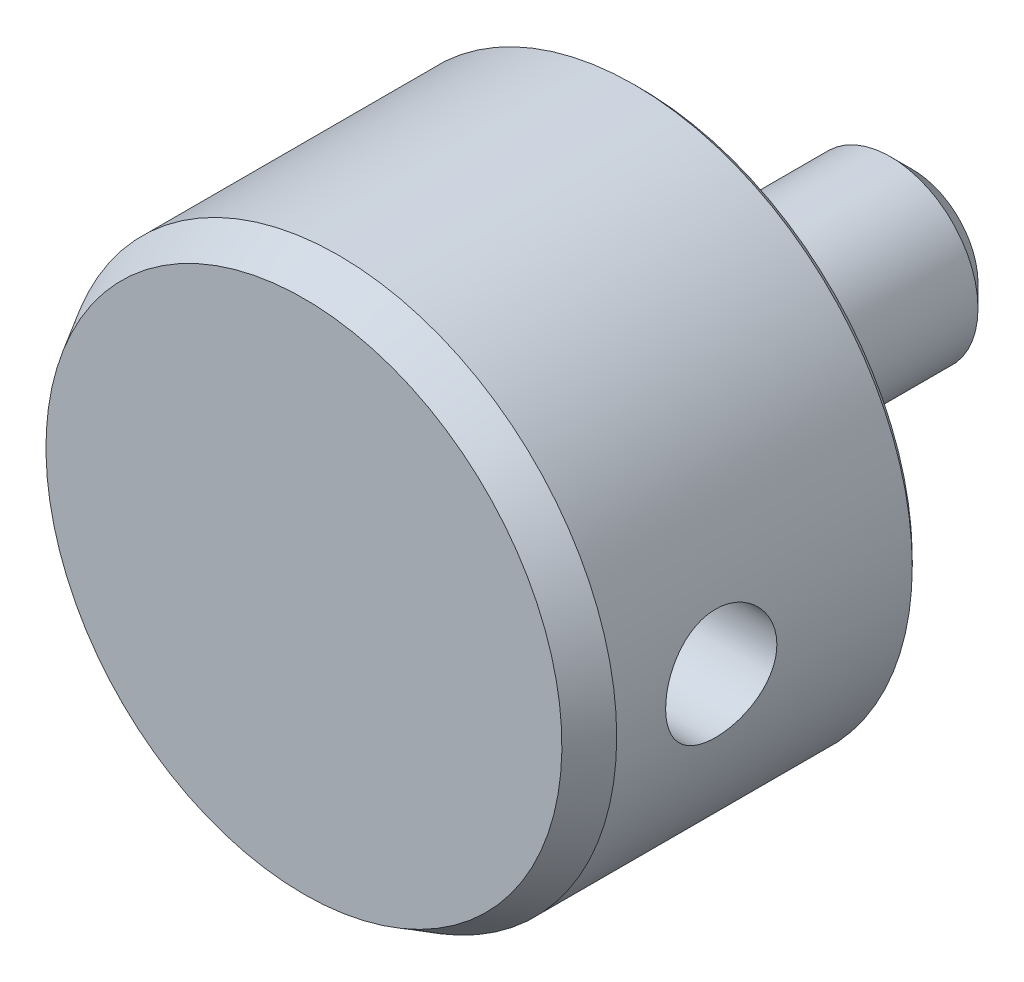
ISO-10303-21;
HEADER;
FILE_DESCRIPTION(('STEP AP214'),'2;1');
FILE_NAME('part.step','',(''),(''),'','','');
FILE_SCHEMA(('AUTOMOTIVE_DESIGN { 1 0 10303 214 1 1 1 1 }'));
ENDSEC;
DATA;
#1=APPLICATION_CONTEXT('core data for automotive mechanical design processes');
#2=APPLICATION_PROTOCOL_DEFINITION('international standard','automotive_design',2000,#1);
#3=PRODUCT_CONTEXT('',#1,'mechanical');
#4=PRODUCT('Part','Part','',(#3));
#5=PRODUCT_RELATED_PRODUCT_CATEGORY('part','',(#4));
#6=PRODUCT_DEFINITION_FORMATION('','',#4);
#7=PRODUCT_DEFINITION_CONTEXT('part definition',#1,'design');
#8=PRODUCT_DEFINITION('design','',#6,#7);
#9=PRODUCT_DEFINITION_SHAPE('','',#8);
#10=(LENGTH_UNIT() NAMED_UNIT(*) SI_UNIT(.MILLI.,.METRE.));
#11=(NAMED_UNIT(*) PLANE_ANGLE_UNIT() SI_UNIT($,.RADIAN.));
#12=(NAMED_UNIT(*) SI_UNIT($,.STERADIAN.) SOLID_ANGLE_UNIT());
#13=UNCERTAINTY_MEASURE_WITH_UNIT(LENGTH_MEASURE(1.E-05),#10,'distance_accuracy_value','');
#14=(GEOMETRIC_REPRESENTATION_CONTEXT(3) GLOBAL_UNCERTAINTY_ASSIGNED_CONTEXT((#13)) GLOBAL_UNIT_ASSIGNED_CONTEXT((#10,
#11,#12)) REPRESENTATION_CONTEXT('',''));
#15=CARTESIAN_POINT('',(0.,0.,0.));
#16=DIRECTION('',(0.,0.,1.));
#17=DIRECTION('',(1.,0.,0.));
#18=AXIS2_PLACEMENT_3D('',#15,#16,#17);
#19=CARTESIAN_POINT('',(0.,0.,-30.1625));
#20=DIRECTION('',(0.,0.,-1.));
#21=DIRECTION('',(0.,-1.,0.));
#22=AXIS2_PLACEMENT_3D('',#19,#20,#21);
#23=CYLINDRICAL_SURFACE('',#22,9.99998);
#24=CARTESIAN_POINT('',(0.,0.,-8.16631719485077));
#25=DIRECTION('',(0.,0.,-1.));
#26=DIRECTION('',(0.,-1.,0.));
#27=AXIS2_PLACEMENT_3D('',#24,#25,#26);
#28=CIRCLE('',#27,9.99998);
#29=CARTESIAN_POINT('',(0.,-9.99998000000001,-8.16631719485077));
#30=VERTEX_POINT('',#29);
#31=EDGE_CURVE('E97',#30,#30,#28,.T.);
#32=ORIENTED_EDGE('',*,*,#31,.T.);
#33=EDGE_LOOP('',(#32));
#34=FACE_BOUND('',#33,.T.);
#35=CARTESIAN_POINT('',(0.,0.,-27.7));
#36=DIRECTION('',(0.,0.,1.));
#37=DIRECTION('',(1.,0.,0.));
#38=AXIS2_PLACEMENT_3D('',#35,#36,#37);
#39=CIRCLE('',#38,9.99998);
#40=CARTESIAN_POINT('',(9.99998,0.,-27.7));
#41=VERTEX_POINT('',#40);
#42=EDGE_CURVE('E93',#41,#41,#39,.T.);
#43=ORIENTED_EDGE('',*,*,#42,.T.);
#44=EDGE_LOOP('',(#43));
#45=FACE_BOUND('',#44,.T.);
#46=ADVANCED_FACE('F12',(#34,#45),#23,.T.);
#47=CARTESIAN_POINT('',(0.,0.,-8.16631719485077));
#48=DIRECTION('',(0.,0.,-1.));
#49=DIRECTION('',(0.,-1.,0.));
#50=AXIS2_PLACEMENT_3D('',#47,#48,#49);
#51=CONICAL_SURFACE('',#50,9.99998,0.523598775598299);
#52=CARTESIAN_POINT('',(0.,0.,-4.572));
#53=DIRECTION('',(0.,0.,-1.));
#54=DIRECTION('',(0.,-1.,0.));
#55=AXIS2_PLACEMENT_3D('',#52,#53,#54);
#56=CIRCLE('',#55,7.9248);
#57=CARTESIAN_POINT('',(0.,-7.9248,-4.572));
#58=VERTEX_POINT('',#57);
#59=EDGE_CURVE('E100',#58,#58,#56,.T.);
#60=ORIENTED_EDGE('',*,*,#59,.T.);
#61=EDGE_LOOP('',(#60));
#62=FACE_BOUND('',#61,.T.);
#63=ORIENTED_EDGE('',*,*,#31,.F.);
#64=EDGE_LOOP('',(#63));
#65=FACE_BOUND('',#64,.T.);
#66=ADVANCED_FACE('F56',(#62,#65),#51,.T.);
#67=CARTESIAN_POINT('',(0.,0.,-30.1625));
#68=DIRECTION('',(0.,0.,-1.));
#69=DIRECTION('',(0.,-1.,0.));
#70=AXIS2_PLACEMENT_3D('',#67,#68,#69);
#71=CYLINDRICAL_SURFACE('',#70,7.9248);
#72=CARTESIAN_POINT('',(0.,0.,0.));
#73=DIRECTION('',(0.,0.,-1.));
#74=DIRECTION('',(0.,-1.,0.));
#75=AXIS2_PLACEMENT_3D('',#72,#73,#74);
#76=CIRCLE('',#75,7.9248);
#77=CARTESIAN_POINT('',(0.,-7.9248,0.));
#78=VERTEX_POINT('',#77);
#79=EDGE_CURVE('E113',#78,#78,#76,.T.);
#80=ORIENTED_EDGE('',*,*,#79,.T.);
#81=EDGE_LOOP('',(#80));
#82=FACE_BOUND('',#81,.T.);
#83=ORIENTED_EDGE('',*,*,#59,.F.);
#84=EDGE_LOOP('',(#83));
#85=FACE_BOUND('',#84,.T.);
#86=ADVANCED_FACE('F60',(#82,#85),#71,.T.);
#87=CARTESIAN_POINT('',(0.,-7.9248,0.));
#88=DIRECTION('',(0.,0.,-1.));
#89=DIRECTION('',(0.,-1.,0.));
#90=AXIS2_PLACEMENT_3D('',#87,#88,#89);
#91=PLANE('',#90);
#92=CARTESIAN_POINT('',(0.,0.,0.));
#93=DIRECTION('',(0.,0.,-1.));
#94=DIRECTION('',(0.,-1.,0.));
#95=AXIS2_PLACEMENT_3D('',#92,#93,#94);
#96=CIRCLE('',#95,12.7);
#97=CARTESIAN_POINT('',(0.,-12.7,0.));
#98=VERTEX_POINT('',#97);
#99=EDGE_CURVE('E110',#98,#98,#96,.T.);
#100=ORIENTED_EDGE('',*,*,#99,.T.);
#101=EDGE_LOOP('',(#100));
#102=FACE_BOUND('',#101,.T.);
#103=ORIENTED_EDGE('',*,*,#79,.F.);
#104=EDGE_LOOP('',(#103));
#105=FACE_BOUND('',#104,.T.);
#106=ADVANCED_FACE('F64',(#102,#105),#91,.T.);
#107=CARTESIAN_POINT('',(0.,0.,-30.1625));
#108=DIRECTION('',(0.,0.,-1.));
#109=DIRECTION('',(0.,-1.,0.));
#110=AXIS2_PLACEMENT_3D('',#107,#108,#109);
#111=CYLINDRICAL_SURFACE('',#110,12.7);
#112=CARTESIAN_POINT('',(0.,0.,0.79375));
#113=DIRECTION('',(0.,0.,-1.));
#114=DIRECTION('',(0.,-1.,0.));
#115=AXIS2_PLACEMENT_3D('',#112,#113,#114);
#116=CIRCLE('',#115,12.7);
#117=CARTESIAN_POINT('',(0.,-12.7,0.79375));
#118=VERTEX_POINT('',#117);
#119=EDGE_CURVE('E107',#118,#118,#116,.T.);
#120=ORIENTED_EDGE('',*,*,#119,.T.);
#121=EDGE_LOOP('',(#120));
#122=FACE_BOUND('',#121,.T.);
#123=ORIENTED_EDGE('',*,*,#99,.F.);
#124=EDGE_LOOP('',(#123));
#125=FACE_BOUND('',#124,.T.);
#126=ADVANCED_FACE('F68',(#122,#125),#111,.T.);
#127=CARTESIAN_POINT('',(0.,-12.7,0.79375));
#128=DIRECTION('',(0.,0.,-1.));
#129=DIRECTION('',(0.,-1.,0.));
#130=AXIS2_PLACEMENT_3D('',#127,#128,#129);
#131=PLANE('',#130);
#132=CARTESIAN_POINT('',(0.,0.,0.79375));
#133=DIRECTION('',(0.,0.,-1.));
#134=DIRECTION('',(0.,-1.,0.));
#135=AXIS2_PLACEMENT_3D('',#132,#133,#134);
#136=CIRCLE('',#135,30.988);
#137=CARTESIAN_POINT('',(0.,-30.988,0.79375));
#138=VERTEX_POINT('',#137);
#139=EDGE_CURVE('E104',#138,#138,#136,.T.);
#140=ORIENTED_EDGE('',*,*,#139,.T.);
#141=EDGE_LOOP('',(#140));
#142=FACE_BOUND('',#141,.T.);
#143=ORIENTED_EDGE('',*,*,#119,.F.);
#144=EDGE_LOOP('',(#143));
#145=FACE_BOUND('',#144,.T.);
#146=ADVANCED_FACE('F52',(#142,#145),#131,.T.);
#147=CARTESIAN_POINT('',(0.,-29.4586411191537,39.27475));
#148=DIRECTION('',(0.,0.,1.));
#149=DIRECTION('',(0.,1.,0.));
#150=AXIS2_PLACEMENT_3D('',#147,#148,#149);
#151=PLANE('',#150);
#152=CARTESIAN_POINT('',(0.,0.,39.27475));
#153=DIRECTION('',(0.,0.,-1.));
#154=DIRECTION('',(0.,-1.,0.));
#155=AXIS2_PLACEMENT_3D('',#152,#153,#154);
#156=CIRCLE('',#155,29.4586411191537);
#157=CARTESIAN_POINT('',(0.,-29.4586411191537,39.27475));
#158=VERTEX_POINT('',#157);
#159=EDGE_CURVE('E31',#158,#158,#156,.T.);
#160=ORIENTED_EDGE('',*,*,#159,.F.);
#161=EDGE_LOOP('',(#160));
#162=FACE_BOUND('',#161,.T.);
#163=ADVANCED_FACE('F49',(#162),#151,.T.);
#164=CARTESIAN_POINT('',(0.,0.,0.79375));
#165=DIRECTION('',(0.,0.,1.));
#166=DIRECTION('',(0.,1.,0.));
#167=AXIS2_PLACEMENT_3D('',#164,#165,#166);
#168=CONICAL_SURFACE('',#167,30.988,0.78539816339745);
#169=CARTESIAN_POINT('',(0.,0.,1.55575));
#170=DIRECTION('',(0.,0.,-1.));
#171=DIRECTION('',(0.,-1.,0.));
#172=AXIS2_PLACEMENT_3D('',#169,#170,#171);
#173=CIRCLE('',#172,31.75);
#174=CARTESIAN_POINT('',(0.,-31.75,1.55575));
#175=VERTEX_POINT('',#174);
#176=EDGE_CURVE('E37',#175,#175,#173,.T.);
#177=ORIENTED_EDGE('',*,*,#176,.T.);
#178=EDGE_LOOP('',(#177));
#179=FACE_BOUND('',#178,.T.);
#180=ORIENTED_EDGE('',*,*,#139,.F.);
#181=EDGE_LOOP('',(#180));
#182=FACE_BOUND('',#181,.T.);
#183=ADVANCED_FACE('F47',(#179,#182),#168,.T.);
#184=CARTESIAN_POINT('',(0.,0.,35.306));
#185=DIRECTION('',(0.,0.,-1.));
#186=DIRECTION('',(0.,-1.,0.));
#187=AXIS2_PLACEMENT_3D('',#184,#185,#186);
#188=CONICAL_SURFACE('',#187,31.75,0.523598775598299);
#189=ORIENTED_EDGE('',*,*,#159,.T.);
#190=EDGE_LOOP('',(#189));
#191=FACE_BOUND('',#190,.T.);
#192=CARTESIAN_POINT('',(0.,0.,35.306));
#193=DIRECTION('',(0.,0.,-1.));
#194=DIRECTION('',(0.,-1.,0.));
#195=AXIS2_PLACEMENT_3D('',#192,#193,#194);
#196=CIRCLE('',#195,31.75);
#197=CARTESIAN_POINT('',(0.,-31.75,35.306));
#198=VERTEX_POINT('',#197);
#199=EDGE_CURVE('E27',#198,#198,#196,.T.);
#200=ORIENTED_EDGE('',*,*,#199,.F.);
#201=EDGE_LOOP('',(#200));
#202=FACE_BOUND('',#201,.T.);
#203=ADVANCED_FACE('F42',(#191,#202),#188,.T.);
#204=CARTESIAN_POINT('',(0.,0.,-30.1625));
#205=DIRECTION('',(0.,0.,-1.));
#206=DIRECTION('',(0.,-1.,0.));
#207=AXIS2_PLACEMENT_3D('',#204,#205,#206);
#208=CYLINDRICAL_SURFACE('',#207,31.75);
#209=CARTESIAN_POINT('',(-31.75,0.,17.018));
#210=CARTESIAN_POINT('',(-31.750001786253,-0.17651587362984,17.0179964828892));
#211=CARTESIAN_POINT('',(-31.7485254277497,-0.352987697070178,17.0253620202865));
#212=CARTESIAN_POINT('',(-31.7426651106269,-0.704709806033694,17.0547588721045));
#213=CARTESIAN_POINT('',(-31.7382806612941,-0.879959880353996,17.076792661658));
#214=CARTESIAN_POINT('',(-31.7267212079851,-1.22801018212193,17.1353715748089));
#215=CARTESIAN_POINT('',(-31.7195447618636,-1.40080909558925,17.1719241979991));
#216=CARTESIAN_POINT('',(-31.7025988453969,-1.74270808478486,17.2592678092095));
#217=CARTESIAN_POINT('',(-31.6928284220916,-1.91180677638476,17.3100640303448));
#218=CARTESIAN_POINT('',(-31.6709811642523,-2.24483065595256,17.4254207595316));
#219=CARTESIAN_POINT('',(-31.6589074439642,-2.40876248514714,17.4899626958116));
#220=CARTESIAN_POINT('',(-31.6327719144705,-2.73062697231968,17.6323954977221));
#221=CARTESIAN_POINT('',(-31.6187093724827,-2.88855739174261,17.7102912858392));
#222=CARTESIAN_POINT('',(-31.5889902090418,-3.19722223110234,17.878812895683));
#223=CARTESIAN_POINT('',(-31.5733343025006,-3.34795983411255,17.9694330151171));
#224=CARTESIAN_POINT('',(-31.5408421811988,-3.64136966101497,18.1628283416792));
#225=CARTESIAN_POINT('',(-31.5240055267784,-3.78403884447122,18.2656080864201));
#226=CARTESIAN_POINT('',(-31.4894105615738,-4.06194074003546,18.4838705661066));
#227=CARTESIAN_POINT('',(-31.4716437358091,-4.19706617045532,18.599488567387));
#228=CARTESIAN_POINT('',(-31.435860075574,-4.45717927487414,18.8416722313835));
#229=CARTESIAN_POINT('',(-31.4178431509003,-4.58216317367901,18.9682419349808));
#230=CARTESIAN_POINT('',(-31.3820725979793,-4.82105872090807,19.2313994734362));
#231=CARTESIAN_POINT('',(-31.3643188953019,-4.93497355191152,19.3679844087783));
#232=CARTESIAN_POINT('',(-31.329560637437,-5.15103007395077,19.6503390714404));
#233=CARTESIAN_POINT('',(-31.3125563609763,-5.25316740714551,19.7961121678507));
#234=CARTESIAN_POINT('',(-31.2796421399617,-5.44574317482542,20.0971314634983));
#235=CARTESIAN_POINT('',(-31.2637430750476,-5.5360714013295,20.2524494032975));
#236=CARTESIAN_POINT('',(-31.2336627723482,-5.70333527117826,20.5703672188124));
#237=CARTESIAN_POINT('',(-31.219482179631,-5.78026589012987,20.7329697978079));
#238=CARTESIAN_POINT('',(-31.1932725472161,-5.92007801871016,21.0642092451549));
#239=CARTESIAN_POINT('',(-31.1812425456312,-5.98296581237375,21.2328433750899));
#240=CARTESIAN_POINT('',(-31.1596797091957,-6.09426120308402,21.5749779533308));
#241=CARTESIAN_POINT('',(-31.1501477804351,-6.14266354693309,21.7484801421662));
#242=CARTESIAN_POINT('',(-31.1259929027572,-6.26436580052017,22.269824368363));
#243=CARTESIAN_POINT('',(-31.1154218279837,-6.31616350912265,22.6232665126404));
#244=CARTESIAN_POINT('',(-31.1087311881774,-6.34895807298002,23.155713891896));
#245=CARTESIAN_POINT('',(-31.1080302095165,-6.35239822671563,23.3336494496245));
#246=CARTESIAN_POINT('',(-31.1096704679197,-6.34436208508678,23.6891912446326));
#247=CARTESIAN_POINT('',(-31.1120117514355,-6.33288556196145,23.8667974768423));
#248=CARTESIAN_POINT('',(-31.123422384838,-6.2766899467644,24.391719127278));
#249=CARTESIAN_POINT('',(-31.1368107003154,-6.2105456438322,24.7368888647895));
#250=CARTESIAN_POINT('',(-31.1737072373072,-6.02257965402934,25.4109501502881));
#251=CARTESIAN_POINT('',(-31.1972159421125,-5.90075530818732,25.7398409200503));
#252=CARTESIAN_POINT('',(-31.2518821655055,-5.6040326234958,26.3748075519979));
#253=CARTESIAN_POINT('',(-31.2830903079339,-5.42878112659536,26.6807141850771));
#254=CARTESIAN_POINT('',(-31.3496081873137,-5.03042913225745,27.2590987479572));
#255=CARTESIAN_POINT('',(-31.3849183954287,-4.80732313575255,27.5315728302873));
#256=CARTESIAN_POINT('',(-31.4564408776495,-4.31482460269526,28.0405156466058));
#257=CARTESIAN_POINT('',(-31.4926579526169,-4.04467162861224,28.2762485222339));
#258=CARTESIAN_POINT('',(-31.5613318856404,-3.46827489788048,28.699167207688));
#259=CARTESIAN_POINT('',(-31.5937886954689,-3.16203067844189,28.8863523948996));
#260=CARTESIAN_POINT('',(-31.6513648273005,-2.52132710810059,29.2069996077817));
#261=CARTESIAN_POINT('',(-31.6764726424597,-2.18682455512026,29.3403775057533));
#262=CARTESIAN_POINT('',(-31.7164344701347,-1.49954599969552,29.5488390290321));
#263=CARTESIAN_POINT('',(-31.7312897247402,-1.14677221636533,29.6239297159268));
#264=CARTESIAN_POINT('',(-31.7488996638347,-0.43928922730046,29.7126434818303));
#265=CARTESIAN_POINT('',(-31.751852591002,-0.0847110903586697,29.7272736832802));
#266=CARTESIAN_POINT('',(-31.7458757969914,0.621823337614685,29.6973633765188));
#267=CARTESIAN_POINT('',(-31.73694674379,0.973779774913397,29.6528261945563));
#268=CARTESIAN_POINT('',(-31.7083333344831,1.66183092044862,29.5066824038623));
#269=CARTESIAN_POINT('',(-31.6887464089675,1.99803979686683,29.405592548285));
#270=CARTESIAN_POINT('',(-31.6410055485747,2.64873510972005,29.1497764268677));
#271=CARTESIAN_POINT('',(-31.6128509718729,2.96321991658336,28.9950461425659));
#272=CARTESIAN_POINT('',(-31.5506044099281,3.56578616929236,28.6341672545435));
#273=CARTESIAN_POINT('',(-31.5164439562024,3.85349724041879,28.4274123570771));
#274=CARTESIAN_POINT('',(-31.4461355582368,4.39050548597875,27.9691476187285));
#275=CARTESIAN_POINT('',(-31.4099874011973,4.6397985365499,27.717632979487));
#276=CARTESIAN_POINT('',(-31.339111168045,5.0967637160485,27.1724694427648));
#277=CARTESIAN_POINT('',(-31.3044130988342,5.30374424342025,26.8782372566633));
#278=CARTESIAN_POINT('',(-31.240994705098,5.66539258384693,26.2583906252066));
#279=CARTESIAN_POINT('',(-31.2122741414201,5.82006248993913,25.9327774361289));
#280=CARTESIAN_POINT('',(-31.1762701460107,6.00888128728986,25.4290562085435));
#281=CARTESIAN_POINT('',(-31.1654635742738,6.06455145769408,25.2589710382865));
#282=CARTESIAN_POINT('',(-31.1464680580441,6.16137084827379,24.9145896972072));
#283=CARTESIAN_POINT('',(-31.1382781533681,6.20252539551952,24.7402950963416));
#284=CARTESIAN_POINT('',(-31.1247656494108,6.26997942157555,24.3887413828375));
#285=CARTESIAN_POINT('',(-31.1194432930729,6.29627764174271,24.2114820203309));
#286=CARTESIAN_POINT('',(-31.1118270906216,6.33380495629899,23.8553123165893));
#287=CARTESIAN_POINT('',(-31.1095331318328,6.34503461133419,23.6764020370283));
#288=CARTESIAN_POINT('',(-31.1080575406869,6.35226474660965,23.3215129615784));
#289=CARTESIAN_POINT('',(-31.1088201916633,6.34853785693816,23.1455398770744));
#290=CARTESIAN_POINT('',(-31.113309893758,6.32649775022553,22.7945503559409));
#291=CARTESIAN_POINT('',(-31.1170368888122,6.30818480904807,22.6195339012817));
#292=CARTESIAN_POINT('',(-31.1273463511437,6.25711483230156,22.2716775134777));
#293=CARTESIAN_POINT('',(-31.1339293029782,6.22435534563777,22.0988379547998));
#294=CARTESIAN_POINT('',(-31.1497552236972,6.14466408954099,21.7566485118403));
#295=CARTESIAN_POINT('',(-31.1589972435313,6.09773737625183,21.5872974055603));
#296=CARTESIAN_POINT('',(-31.179852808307,5.99018114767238,21.2535484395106));
#297=CARTESIAN_POINT('',(-31.1914613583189,5.92958046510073,21.0891409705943));
#298=CARTESIAN_POINT('',(-31.2167268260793,5.79509639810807,20.7660852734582));
#299=CARTESIAN_POINT('',(-31.2303830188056,5.72121771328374,20.6074350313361));
#300=CARTESIAN_POINT('',(-31.2593696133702,5.56066227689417,20.2968256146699));
#301=CARTESIAN_POINT('',(-31.2747007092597,5.47398021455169,20.1448692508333));
#302=CARTESIAN_POINT('',(-31.3066021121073,5.2884794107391,19.8487674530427));
#303=CARTESIAN_POINT('',(-31.3231719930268,5.18966483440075,19.7046193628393));
#304=CARTESIAN_POINT('',(-31.3573974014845,4.97872853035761,19.4225840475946));
#305=CARTESIAN_POINT('',(-31.3750667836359,4.86640554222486,19.284848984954));
#306=CARTESIAN_POINT('',(-31.4107227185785,4.63068014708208,19.0193443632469));
#307=CARTESIAN_POINT('',(-31.4287091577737,4.50728164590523,18.8915713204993));
#308=CARTESIAN_POINT('',(-31.464516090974,4.25012766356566,18.6467234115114));
#309=CARTESIAN_POINT('',(-31.4823364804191,4.11636609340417,18.5296549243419));
#310=CARTESIAN_POINT('',(-31.517300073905,3.83949929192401,18.3071427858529));
#311=CARTESIAN_POINT('',(-31.5344435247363,3.69639751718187,18.2016948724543));
#312=CARTESIAN_POINT('',(-31.5677659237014,3.40016257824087,18.0020290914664));
#313=CARTESIAN_POINT('',(-31.5839323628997,3.24693728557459,17.9079457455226));
#314=CARTESIAN_POINT('',(-31.6146312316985,2.93299471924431,17.7330805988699));
#315=CARTESIAN_POINT('',(-31.629164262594,2.77228023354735,17.6522938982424));
#316=CARTESIAN_POINT('',(-31.6561810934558,2.4445256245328,17.5046328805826));
#317=CARTESIAN_POINT('',(-31.6686661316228,2.27748939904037,17.4377501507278));
#318=CARTESIAN_POINT('',(-31.6912384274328,1.93825421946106,17.3183706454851));
#319=CARTESIAN_POINT('',(-31.7013261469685,1.76605626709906,17.265871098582));
#320=CARTESIAN_POINT('',(-31.7230870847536,1.33248673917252,17.1536066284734));
#321=CARTESIAN_POINT('',(-31.7331270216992,1.06865101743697,17.1028235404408));
#322=CARTESIAN_POINT('',(-31.7465820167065,0.536509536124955,17.0350234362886));
#323=CARTESIAN_POINT('',(-31.7499972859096,0.268203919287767,17.0180053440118));
#324=CARTESIAN_POINT('',(-31.75,0.,17.018));
#325=B_SPLINE_CURVE_WITH_KNOTS('',3,(#209,#210,#211,#212,#213,#214,#215,#216,#217,#218,#219,
#220,#221,#222,#223,#224,#225,#226,#227,#228,#229,#230,#231,#232,#233,#234,#235,#236,#237,#238,
#239,#240,#241,#242,#243,#244,#245,#246,#247,#248,#249,#250,#251,#252,#253,#254,#255,#256,#257,
#258,#259,#260,#261,#262,#263,#264,#265,#266,#267,#268,#269,#270,#271,#272,#273,#274,#275,#276,
#277,#278,#279,#280,#281,#282,#283,#284,#285,#286,#287,#288,#289,#290,#291,#292,#293,#294,#295,
#296,#297,#298,#299,#300,#301,#302,#303,#304,#305,#306,#307,#308,#309,#310,#311,#312,#313,#314,
#315,#316,#317,#318,#319,#320,#321,#322,#323,#324),.UNSPECIFIED.,.T.,.F.,(4,2,2,2,2,2,2,2,2,2,2,
2,2,2,2,2,2,2,2,2,2,2,2,2,2,2,2,2,2,2,2,2,2,2,2,2,2,2,2,2,2,2,2,2,2,2,2,2,2,2,2,2,2,2,2,2,2,4),
(0.,0.529312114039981,1.05871356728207,1.58838883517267,2.11825896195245,2.64741767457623,
3.17677186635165,3.7058895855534,4.23520538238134,4.77075073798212,5.30649454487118,
5.8420838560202,6.37787071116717,6.91834660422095,7.45902475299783,7.99946046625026,
8.54009193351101,9.60600520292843,10.1393933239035,10.672789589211,11.7225222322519,
12.772305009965,13.8291831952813,14.8861828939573,15.9621966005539,17.0382241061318,
18.1159275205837,19.1935003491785,20.253049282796,21.3125386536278,22.3625013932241,
23.4125428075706,24.4754392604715,25.5384497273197,26.617647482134,27.6968020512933,
28.2341330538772,28.7712666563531,29.3084457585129,29.8456048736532,30.3730174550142,
30.9004200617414,31.4279121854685,31.9552162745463,32.4814187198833,33.0074352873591,
33.533670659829,34.0597258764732,34.594914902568,35.1299159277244,35.665233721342,
36.2003545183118,36.7412917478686,37.2820291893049,37.8224384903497,38.3627435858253,
39.1670231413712,39.9712770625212),.UNSPECIFIED.);
#326=CARTESIAN_POINT('',(-31.75,0.,17.018));
#327=VERTEX_POINT('',#326);
#328=EDGE_CURVE('E23',#327,#327,#325,.T.);
#329=ORIENTED_EDGE('',*,*,#328,.F.);
#330=EDGE_LOOP('',(#329));
#331=FACE_BOUND('',#330,.T.);
#332=CARTESIAN_POINT('',(31.75,0.,17.018));
#333=CARTESIAN_POINT('',(31.750001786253,0.176515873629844,17.0179964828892));
#334=CARTESIAN_POINT('',(31.7485254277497,0.352987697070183,17.0253620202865));
#335=CARTESIAN_POINT('',(31.7426651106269,0.704709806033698,17.0547588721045));
#336=CARTESIAN_POINT('',(31.7382806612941,0.879959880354,17.076792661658));
#337=CARTESIAN_POINT('',(31.7267212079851,1.22801018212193,17.1353715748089));
#338=CARTESIAN_POINT('',(31.7195447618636,1.40080909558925,17.1719241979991));
#339=CARTESIAN_POINT('',(31.7025988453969,1.74270808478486,17.2592678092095));
#340=CARTESIAN_POINT('',(31.6928284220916,1.91180677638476,17.3100640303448));
#341=CARTESIAN_POINT('',(31.6709811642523,2.24483065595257,17.4254207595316));
#342=CARTESIAN_POINT('',(31.6589074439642,2.40876248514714,17.4899626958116));
#343=CARTESIAN_POINT('',(31.6327719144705,2.73062697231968,17.6323954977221));
#344=CARTESIAN_POINT('',(31.6187093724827,2.88855739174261,17.7102912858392));
#345=CARTESIAN_POINT('',(31.5889902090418,3.19722223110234,17.878812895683));
#346=CARTESIAN_POINT('',(31.5733343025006,3.34795983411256,17.9694330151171));
#347=CARTESIAN_POINT('',(31.5408421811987,3.64136966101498,18.1628283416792));
#348=CARTESIAN_POINT('',(31.5240055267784,3.78403884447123,18.26560808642));
#349=CARTESIAN_POINT('',(31.4894105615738,4.06194074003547,18.4838705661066));
#350=CARTESIAN_POINT('',(31.4716437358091,4.19706617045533,18.599488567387));
#351=CARTESIAN_POINT('',(31.435860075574,4.45717927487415,18.8416722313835));
#352=CARTESIAN_POINT('',(31.4178431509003,4.58216317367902,18.9682419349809));
#353=CARTESIAN_POINT('',(31.3820725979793,4.82105872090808,19.2313994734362));
#354=CARTESIAN_POINT('',(31.3643188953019,4.93497355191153,19.3679844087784));
#355=CARTESIAN_POINT('',(31.329560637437,5.15103007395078,19.6503390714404));
#356=CARTESIAN_POINT('',(31.3125563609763,5.25316740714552,19.7961121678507));
#357=CARTESIAN_POINT('',(31.2796421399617,5.44574317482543,20.0971314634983));
#358=CARTESIAN_POINT('',(31.2637430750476,5.53607140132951,20.2524494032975));
#359=CARTESIAN_POINT('',(31.2336627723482,5.70333527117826,20.5703672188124));
#360=CARTESIAN_POINT('',(31.219482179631,5.78026589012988,20.7329697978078));
#361=CARTESIAN_POINT('',(31.1932725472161,5.92007801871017,21.0642092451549));
#362=CARTESIAN_POINT('',(31.1812425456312,5.98296581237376,21.2328433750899));
#363=CARTESIAN_POINT('',(31.1596797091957,6.09426120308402,21.5749779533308));
#364=CARTESIAN_POINT('',(31.1501477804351,6.14266354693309,21.7484801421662));
#365=CARTESIAN_POINT('',(31.1259929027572,6.26436580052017,22.269824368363));
#366=CARTESIAN_POINT('',(31.1154218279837,6.31616350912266,22.6232665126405));
#367=CARTESIAN_POINT('',(31.1087311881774,6.34895807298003,23.155713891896));
#368=CARTESIAN_POINT('',(31.1080302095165,6.35239822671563,23.3336494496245));
#369=CARTESIAN_POINT('',(31.1096704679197,6.34436208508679,23.6891912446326));
#370=CARTESIAN_POINT('',(31.1120117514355,6.33288556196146,23.8667974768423));
#371=CARTESIAN_POINT('',(31.123422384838,6.27668994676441,24.391719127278));
#372=CARTESIAN_POINT('',(31.1368107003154,6.21054564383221,24.7368888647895));
#373=CARTESIAN_POINT('',(31.1737072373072,6.02257965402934,25.4109501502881));
#374=CARTESIAN_POINT('',(31.1972159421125,5.90075530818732,25.7398409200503));
#375=CARTESIAN_POINT('',(31.2518821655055,5.60403262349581,26.3748075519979));
#376=CARTESIAN_POINT('',(31.2830903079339,5.42878112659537,26.6807141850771));
#377=CARTESIAN_POINT('',(31.3496081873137,5.03042913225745,27.2590987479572));
#378=CARTESIAN_POINT('',(31.3849183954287,4.80732313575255,27.5315728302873));
#379=CARTESIAN_POINT('',(31.4564408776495,4.31482460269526,28.0405156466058));
#380=CARTESIAN_POINT('',(31.4926579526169,4.04467162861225,28.2762485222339));
#381=CARTESIAN_POINT('',(31.5613318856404,3.46827489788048,28.699167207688));
#382=CARTESIAN_POINT('',(31.5937886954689,3.16203067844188,28.8863523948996));
#383=CARTESIAN_POINT('',(31.6513648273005,2.52132710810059,29.2069996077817));
#384=CARTESIAN_POINT('',(31.6764726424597,2.18682455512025,29.3403775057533));
#385=CARTESIAN_POINT('',(31.7164344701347,1.49954599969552,29.5488390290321));
#386=CARTESIAN_POINT('',(31.7312897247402,1.14677221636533,29.6239297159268));
#387=CARTESIAN_POINT('',(31.7488996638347,0.43928922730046,29.7126434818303));
#388=CARTESIAN_POINT('',(31.751852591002,0.0847110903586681,29.7272736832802));
#389=CARTESIAN_POINT('',(31.7458757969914,-0.621823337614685,29.6973633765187));
#390=CARTESIAN_POINT('',(31.73694674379,-0.973779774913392,29.6528261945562));
#391=CARTESIAN_POINT('',(31.7083333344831,-1.66183092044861,29.5066824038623));
#392=CARTESIAN_POINT('',(31.6887464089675,-1.99803979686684,29.405592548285));
#393=CARTESIAN_POINT('',(31.6410055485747,-2.64873510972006,29.1497764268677));
#394=CARTESIAN_POINT('',(31.6128509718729,-2.96321991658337,28.9950461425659));
#395=CARTESIAN_POINT('',(31.5506044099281,-3.56578616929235,28.6341672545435));
#396=CARTESIAN_POINT('',(31.5164439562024,-3.85349724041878,28.4274123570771));
#397=CARTESIAN_POINT('',(31.4461355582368,-4.39050548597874,27.9691476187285));
#398=CARTESIAN_POINT('',(31.4099874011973,-4.63979853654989,27.717632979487));
#399=CARTESIAN_POINT('',(31.339111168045,-5.09676371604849,27.1724694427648));
#400=CARTESIAN_POINT('',(31.3044130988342,-5.30374424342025,26.8782372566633));
#401=CARTESIAN_POINT('',(31.240994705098,-5.66539258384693,26.2583906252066));
#402=CARTESIAN_POINT('',(31.2122741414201,-5.82006248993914,25.9327774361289));
#403=CARTESIAN_POINT('',(31.1762701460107,-6.00888128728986,25.4290562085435));
#404=CARTESIAN_POINT('',(31.1654635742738,-6.06455145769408,25.2589710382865));
#405=CARTESIAN_POINT('',(31.1464680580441,-6.16137084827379,24.9145896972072));
#406=CARTESIAN_POINT('',(31.1382781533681,-6.20252539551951,24.7402950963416));
#407=CARTESIAN_POINT('',(31.1247656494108,-6.26997942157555,24.3887413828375));
#408=CARTESIAN_POINT('',(31.1194432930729,-6.2962776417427,24.2114820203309));
#409=CARTESIAN_POINT('',(31.1118270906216,-6.33380495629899,23.8553123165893));
#410=CARTESIAN_POINT('',(31.1095331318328,-6.34503461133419,23.6764020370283));
#411=CARTESIAN_POINT('',(31.1080575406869,-6.35226474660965,23.3215129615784));
#412=CARTESIAN_POINT('',(31.1088201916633,-6.34853785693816,23.1455398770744));
#413=CARTESIAN_POINT('',(31.1133098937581,-6.32649775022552,22.7945503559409));
#414=CARTESIAN_POINT('',(31.1170368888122,-6.30818480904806,22.6195339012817));
#415=CARTESIAN_POINT('',(31.1273463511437,-6.25711483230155,22.2716775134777));
#416=CARTESIAN_POINT('',(31.1339293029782,-6.22435534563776,22.0988379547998));
#417=CARTESIAN_POINT('',(31.1497552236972,-6.14466408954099,21.7566485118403));
#418=CARTESIAN_POINT('',(31.1589972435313,-6.09773737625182,21.5872974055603));
#419=CARTESIAN_POINT('',(31.179852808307,-5.99018114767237,21.2535484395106));
#420=CARTESIAN_POINT('',(31.1914613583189,-5.92958046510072,21.0891409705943));
#421=CARTESIAN_POINT('',(31.2167268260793,-5.79509639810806,20.7660852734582));
#422=CARTESIAN_POINT('',(31.2303830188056,-5.72121771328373,20.6074350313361));
#423=CARTESIAN_POINT('',(31.2593696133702,-5.56066227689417,20.2968256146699));
#424=CARTESIAN_POINT('',(31.2747007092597,-5.47398021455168,20.1448692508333));
#425=CARTESIAN_POINT('',(31.3066021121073,-5.28847941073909,19.8487674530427));
#426=CARTESIAN_POINT('',(31.3231719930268,-5.18966483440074,19.7046193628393));
#427=CARTESIAN_POINT('',(31.3573974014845,-4.9787285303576,19.4225840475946));
#428=CARTESIAN_POINT('',(31.3750667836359,-4.86640554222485,19.284848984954));
#429=CARTESIAN_POINT('',(31.4107227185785,-4.63068014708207,19.0193443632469));
#430=CARTESIAN_POINT('',(31.4287091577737,-4.50728164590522,18.8915713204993));
#431=CARTESIAN_POINT('',(31.464516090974,-4.25012766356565,18.6467234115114));
#432=CARTESIAN_POINT('',(31.4823364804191,-4.11636609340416,18.5296549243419));
#433=CARTESIAN_POINT('',(31.517300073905,-3.839499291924,18.3071427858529));
#434=CARTESIAN_POINT('',(31.5344435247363,-3.69639751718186,18.2016948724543));
#435=CARTESIAN_POINT('',(31.5677659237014,-3.40016257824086,18.0020290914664));
#436=CARTESIAN_POINT('',(31.5839323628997,-3.24693728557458,17.9079457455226));
#437=CARTESIAN_POINT('',(31.6146312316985,-2.9329947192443,17.7330805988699));
#438=CARTESIAN_POINT('',(31.629164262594,-2.77228023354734,17.6522938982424));
#439=CARTESIAN_POINT('',(31.6561810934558,-2.44452562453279,17.5046328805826));
#440=CARTESIAN_POINT('',(31.6686661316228,-2.27748939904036,17.4377501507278));
#441=CARTESIAN_POINT('',(31.6912384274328,-1.93825421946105,17.3183706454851));
#442=CARTESIAN_POINT('',(31.7013261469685,-1.76605626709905,17.265871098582));
#443=CARTESIAN_POINT('',(31.7230870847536,-1.33248673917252,17.1536066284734));
#444=CARTESIAN_POINT('',(31.7331270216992,-1.06865101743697,17.1028235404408));
#445=CARTESIAN_POINT('',(31.7465820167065,-0.53650953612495,17.0350234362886));
#446=CARTESIAN_POINT('',(31.7499972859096,-0.268203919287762,17.0180053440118));
#447=CARTESIAN_POINT('',(31.75,0.,17.018));
#448=B_SPLINE_CURVE_WITH_KNOTS('',3,(#332,#333,#334,#335,#336,#337,#338,#339,#340,#341,#342,
#343,#344,#345,#346,#347,#348,#349,#350,#351,#352,#353,#354,#355,#356,#357,#358,#359,#360,#361,
#362,#363,#364,#365,#366,#367,#368,#369,#370,#371,#372,#373,#374,#375,#376,#377,#378,#379,#380,
#381,#382,#383,#384,#385,#386,#387,#388,#389,#390,#391,#392,#393,#394,#395,#396,#397,#398,#399,
#400,#401,#402,#403,#404,#405,#406,#407,#408,#409,#410,#411,#412,#413,#414,#415,#416,#417,#418,
#419,#420,#421,#422,#423,#424,#425,#426,#427,#428,#429,#430,#431,#432,#433,#434,#435,#436,#437,
#438,#439,#440,#441,#442,#443,#444,#445,#446,#447),.UNSPECIFIED.,.T.,.F.,(4,2,2,2,2,2,2,2,2,2,2,
2,2,2,2,2,2,2,2,2,2,2,2,2,2,2,2,2,2,2,2,2,2,2,2,2,2,2,2,2,2,2,2,2,2,2,2,2,2,2,2,2,2,2,2,2,2,4),
(0.,0.529312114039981,1.05871356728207,1.58838883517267,2.11825896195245,2.64741767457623,
3.17677186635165,3.7058895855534,4.23520538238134,4.77075073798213,5.30649454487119,
5.84208385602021,6.37787071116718,6.91834660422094,7.45902475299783,7.99946046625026,
8.54009193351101,9.60600520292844,10.1393933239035,10.672789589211,11.7225222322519,
12.772305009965,13.8291831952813,14.8861828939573,15.962196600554,17.0382241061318,
18.1159275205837,19.1935003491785,20.253049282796,21.3125386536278,22.3625013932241,
23.4125428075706,24.4754392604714,25.5384497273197,26.617647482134,27.6968020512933,
28.2341330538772,28.7712666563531,29.3084457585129,29.8456048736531,30.3730174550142,
30.9004200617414,31.4279121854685,31.9552162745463,32.4814187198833,33.0074352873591,
33.533670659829,34.0597258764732,34.594914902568,35.1299159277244,35.665233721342,
36.2003545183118,36.7412917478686,37.2820291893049,37.8224384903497,38.3627435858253,
39.1670231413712,39.9712770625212),.UNSPECIFIED.);
#449=CARTESIAN_POINT('',(31.75,0.,17.018));
#450=VERTEX_POINT('',#449);
#451=EDGE_CURVE('E8',#450,#450,#448,.T.);
#452=ORIENTED_EDGE('',*,*,#451,.F.);
#453=EDGE_LOOP('',(#452));
#454=FACE_BOUND('',#453,.T.);
#455=ORIENTED_EDGE('',*,*,#199,.T.);
#456=EDGE_LOOP('',(#455));
#457=FACE_BOUND('',#456,.T.);
#458=ORIENTED_EDGE('',*,*,#176,.F.);
#459=EDGE_LOOP('',(#458));
#460=FACE_BOUND('',#459,.T.);
#461=ADVANCED_FACE('F38',(#331,#454,#457,#460),#208,.T.);
#462=CARTESIAN_POINT('',(-48.41748,0.,23.368));
#463=DIRECTION('',(1.,0.,0.));
#464=DIRECTION('',(0.,0.,-1.));
#465=AXIS2_PLACEMENT_3D('',#462,#463,#464);
#466=CYLINDRICAL_SURFACE('',#465,6.35);
#467=ORIENTED_EDGE('',*,*,#328,.T.);
#468=EDGE_LOOP('',(#467));
#469=FACE_BOUND('',#468,.T.);
#470=ORIENTED_EDGE('',*,*,#451,.T.);
#471=EDGE_LOOP('',(#470));
#472=FACE_BOUND('',#471,.T.);
#473=ADVANCED_FACE('F14',(#469,#472),#466,.F.);
#474=CARTESIAN_POINT('',(0.,7.49998,-30.2));
#475=DIRECTION('',(0.,0.,1.));
#476=DIRECTION('',(1.,0.,0.));
#477=AXIS2_PLACEMENT_3D('',#474,#475,#476);
#478=PLANE('',#477);
#479=CARTESIAN_POINT('',(0.,0.,-30.2));
#480=DIRECTION('',(0.,0.,1.));
#481=DIRECTION('',(1.,0.,0.));
#482=AXIS2_PLACEMENT_3D('',#479,#480,#481);
#483=CIRCLE('',#482,7.49998);
#484=CARTESIAN_POINT('',(7.49998,0.,-30.2));
#485=VERTEX_POINT('',#484);
#486=EDGE_CURVE('E96',#485,#485,#483,.T.);
#487=ORIENTED_EDGE('',*,*,#486,.F.);
#488=EDGE_LOOP('',(#487));
#489=FACE_BOUND('',#488,.T.);
#490=ADVANCED_FACE('F79',(#489),#478,.F.);
#491=CARTESIAN_POINT('',(0.,0.,-30.2));
#492=DIRECTION('',(0.,0.,1.));
#493=DIRECTION('',(1.,0.,0.));
#494=AXIS2_PLACEMENT_3D('',#491,#492,#493);
#495=CONICAL_SURFACE('',#494,7.49998,0.78539816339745);
#496=ORIENTED_EDGE('',*,*,#42,.F.);
#497=EDGE_LOOP('',(#496));
#498=FACE_BOUND('',#497,.T.);
#499=ORIENTED_EDGE('',*,*,#486,.T.);
#500=EDGE_LOOP('',(#499));
#501=FACE_BOUND('',#500,.T.);
#502=ADVANCED_FACE('F82',(#498,#501),#495,.T.);
#503=CLOSED_SHELL('',(#46,#66,#86,#106,#126,#146,#163,#183,#203,#461,#473,#490,#502));
#504=MANIFOLD_SOLID_BREP('B1',#503);
#505=ADVANCED_BREP_SHAPE_REPRESENTATION('',(#18,#504),#14);
#506=SHAPE_DEFINITION_REPRESENTATION(#9,#505);
ENDSEC;
END-ISO-10303-21;
